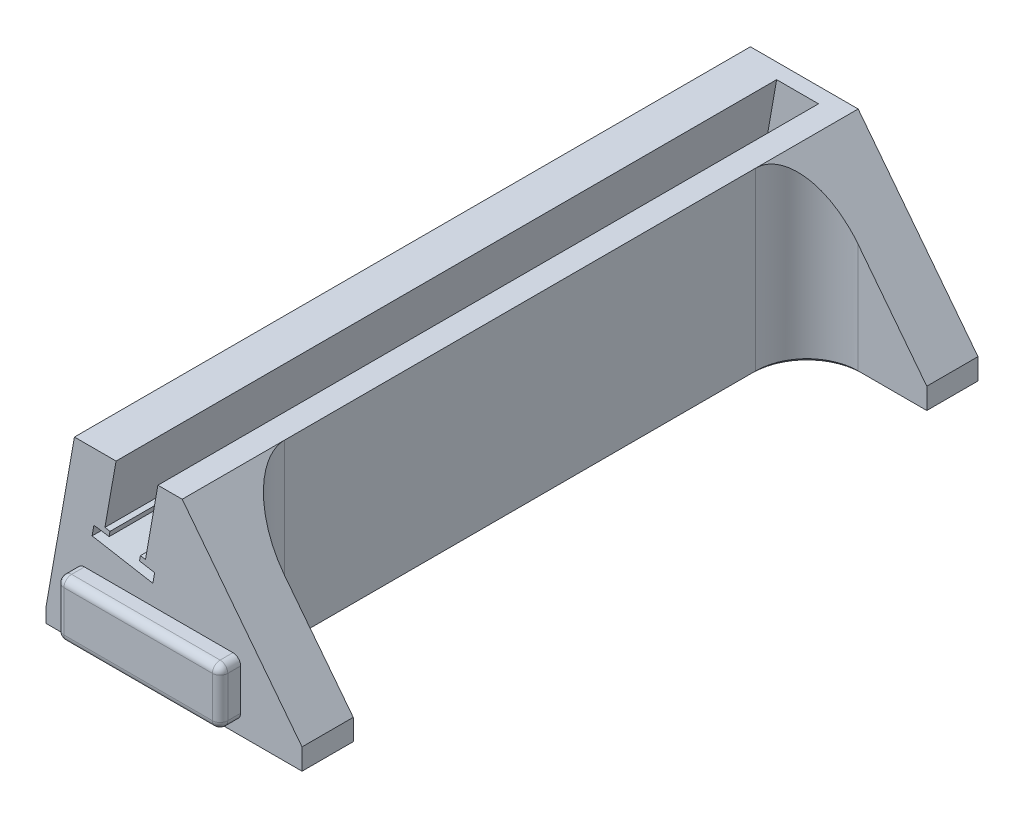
from build123d import *

# Parameters (mm, degrees)
AUFSATZ_LINEAR_AUSTRAGEN1_DEPTH = 132
SKIZZE2_W                       = 23.404053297
SKIZZE2_H                       = 112
SCHNITT_LINEAR_AUSTRAGEN1_DEPTH = 139.83083231
VERRUNDUNG1_R                   = 10
SKIZZE4_W                       = 18.595946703
SKIZZE4_H                       = 110
SCHNITT_LINEAR_AUSTRAGEN3_DEPTH = 12
SKIZZE3_W                       = 32
SKIZZE3_H                       = 11
AUFSATZ_LINEAR_AUSTRAGEN2_DEPTH = 4
VERRUNDUNG2_R                   = 1.5
SKIZZE5_W                       = 18.177594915
SKIZZE5_H                       = 18.176701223
AUFSATZ_LINEAR_AUSTRAGEN3_DEPTH = 3
FASE1_SIZE                      = 0.7


with BuildPart() as part:
    # Skizze1 → Aufsatz-Linear austragen1 (new body)
    with BuildSketch(Plane.XY):
        Polygon((-19.443573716, 15), (-25, -16.512059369), (-25, -20), (25, -20), (25, -15.184189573), (1.595946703, 15), (-3.145976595, 15), (-5.577051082, 1.212691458), (-6.561858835, 1.386339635), (-6.735507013, 0.401531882), (-5.75069926, 0.227883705), (-3.781083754, -0.119412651), (-4.128380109, -2.089028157), (-15.995313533, 0.003432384), (-15.646551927, 1.972788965), (-13.665007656, 1.70171277), (-12.680199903, 1.528064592), (-12.506551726, 2.512872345), (-13.491359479, 2.686520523), (-11.32016082, 15), align=None)
    extrude(amount=AUFSATZ_LINEAR_AUSTRAGEN1_DEPTH)

    # Skizze2 → Schnitt-Linear austragen1 (cut, through all)
    with BuildSketch(Plane(origin=(0, 15, 0), x_dir=(1, 0, 0), z_dir=(0, 1, 0))):
        with Locations((13.297973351, -66)):
            Rectangle(SKIZZE2_W, SKIZZE2_H)
    extrude(amount=-SCHNITT_LINEAR_AUSTRAGEN1_DEPTH, mode=Mode.SUBTRACT)

    # Verrundung1
    verrundung1_edges = [part.edges().sort_by_distance(p)[0] for p in [
        (1.595946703, -2.5, 10),
        (1.595946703, -2.5, 122),
    ]]
    fillet(verrundung1_edges, radius=VERRUNDUNG1_R)

    # Skizze4 → Schnitt-Linear austragen3 (cut)
    with BuildSketch(Plane.XZ.offset(20)):
        with Locations((-11.702026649, 66)):
            Rectangle(SKIZZE4_W, SKIZZE4_H)
    extrude(amount=-SCHNITT_LINEAR_AUSTRAGEN3_DEPTH, mode=Mode.SUBTRACT)

    # Skizze3 → Aufsatz-Linear austragen2 (add)
    with BuildSketch(Plane.XY.offset(132)):
        with Locations((-3, -11.5)):
            Rectangle(SKIZZE3_W, SKIZZE3_H)
    extrude(amount=AUFSATZ_LINEAR_AUSTRAGEN2_DEPTH)

    # Verrundung2
    verrundung2_edges = [part.edges().sort_by_distance(p)[0] for p in [
        (-19, -6, 134),
        (-19, -17, 134),
        (13, -17, 134),
        (13, -6, 134),
        (-19, -11.5, 136),
        (-3, -17, 136),
        (13, -11.5, 136),
        (-3, -6, 136),
    ]]
    fillet(verrundung2_edges, radius=VERRUNDUNG2_R)

    # Skizze5 → Aufsatz-Linear austragen3 (add)
    with BuildSketch(Plane(origin=(0, 0, 0), x_dir=(-1, 0, 0), z_dir=(0, 0, -1))):
        with Locations((8.832117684, 5.911649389)):
            Rectangle(SKIZZE5_W, SKIZZE5_H)
    extrude(amount=-AUFSATZ_LINEAR_AUSTRAGEN3_DEPTH)

    # Fase1
    fase1_edges = [part.edges().sort_by_distance(p)[0] for p in [
        (-21, -20, 66),
        (-11.702026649, -20, 11),
        (-2.404053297, -20, 66),
        (-11.702026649, -20, 121),
        (0, -20, 132),
        (0, -20, 0),
        (25, -20, 127),
        (-25, -20, 66),
        (25, -20, 5),
        (18.297973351, -20, 10),
        (18.297973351, -20, 122),
        (1.595946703, -20, 66),
        (4.524878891, -20, 119.071067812),
        (4.524878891, -20, 12.928932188),
    ]]
    chamfer(fase1_edges, length=FASE1_SIZE)


solid = part.part
